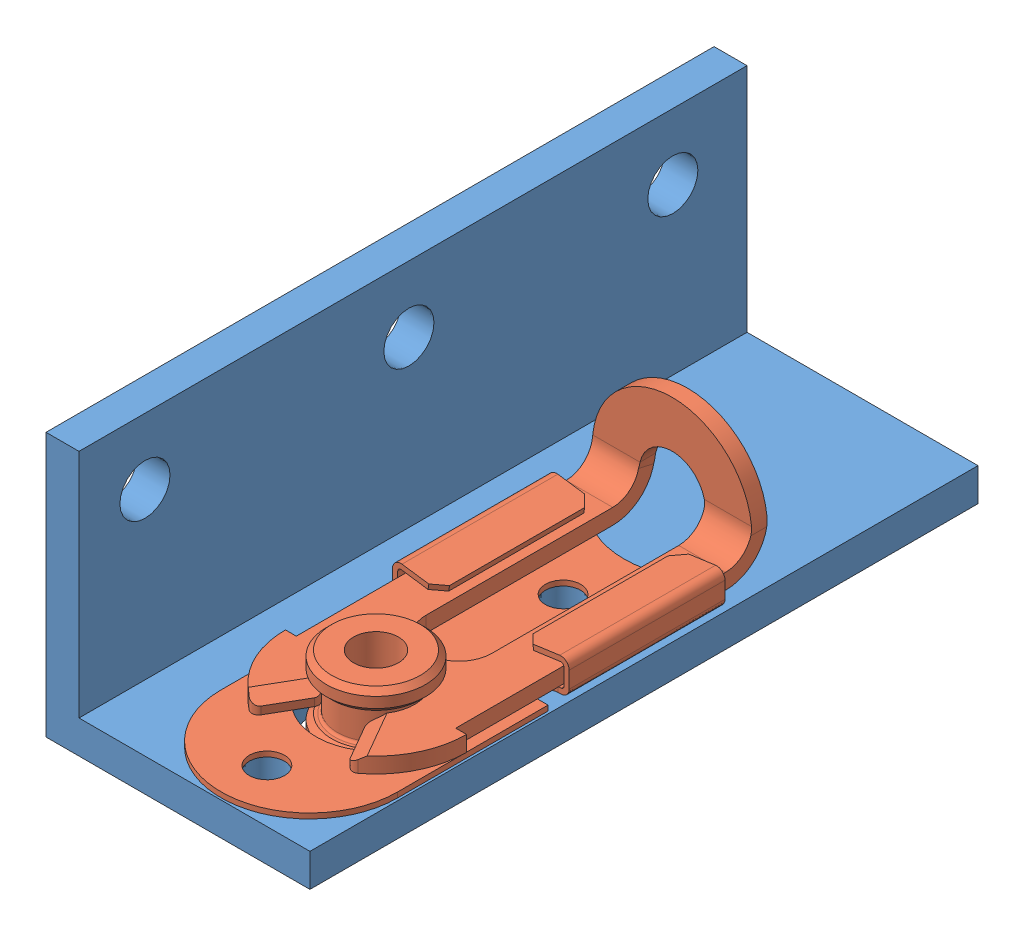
SolidWorks assembly Angle Support Assembly.SLDASM, configuration Default (file format 8000). Lengths in mm.
Overall size (25.4 25.48 64.29).
2 component instances, 2 part files, 3 mates.
Components (placement in the parent):
- Angle Support-1: Angle Support.SLDPRT [Default] at (-39.0515 20.306 -23.409) size (25.4 25.4 64.29)
- 1872A720-1: 1872A720.SLDPRT [Default] at (-22.3828 -1.919 25.7949) x (0 0 -1) z (1 0 0) size (44.91 14.94 17.42)
Mates (geometry in assembly coordinates):
- Coincident1: coincident anti-aligned: plane of Angle Support-1 through (-13.6515 -1.919 40.8848) normal (0 1 0); plane of 1872A720-1 through (-22.3828 -1.919 32.2049) normal (0 -1 0)
- Concentric3: concentric anti-aligned: circle of Angle Support-1; circle of 1872A720-1
- Concentric5: concentric anti-aligned: circle of Angle Support-1; circle of 1872A720-1
